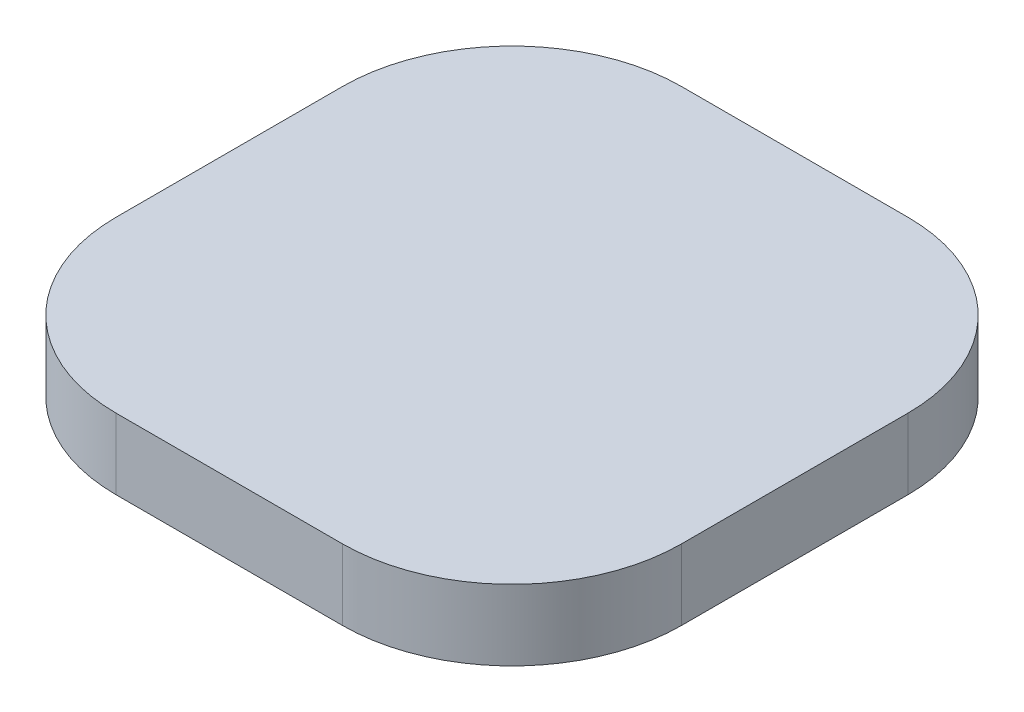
from build123d import *

# Parameters (mm, degrees)
BOSS_EXTRUDE1_DEPTH = 6.35


with BuildPart() as part:
    # Sketch1 → Boss-Extrude1 (new body)
    with BuildSketch(Plane(origin=(0, 0, 0), x_dir=(1, 0, 0), z_dir=(0, 1, 0))):
        with BuildLine():
            Line((15.24, 0), (35.56, 0))
            ThreePointArc((35.56, 0), (46.336307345, 4.463692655), (50.8, 15.24))
            Line((50.8, 15.24), (50.8, 35.56))
            ThreePointArc((50.8, 35.56), (46.336307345, 46.336307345), (35.56, 50.8))
            Line((35.56, 50.8), (15.24, 50.8))
            ThreePointArc((15.24, 50.8), (4.463692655, 46.336307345), (0, 35.56))
            Line((0, 35.56), (0, 15.24))
            ThreePointArc((0, 15.24), (4.463692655, 4.463692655), (15.24, 0))
        make_face()
    extrude(amount=BOSS_EXTRUDE1_DEPTH)


solid = part.part
